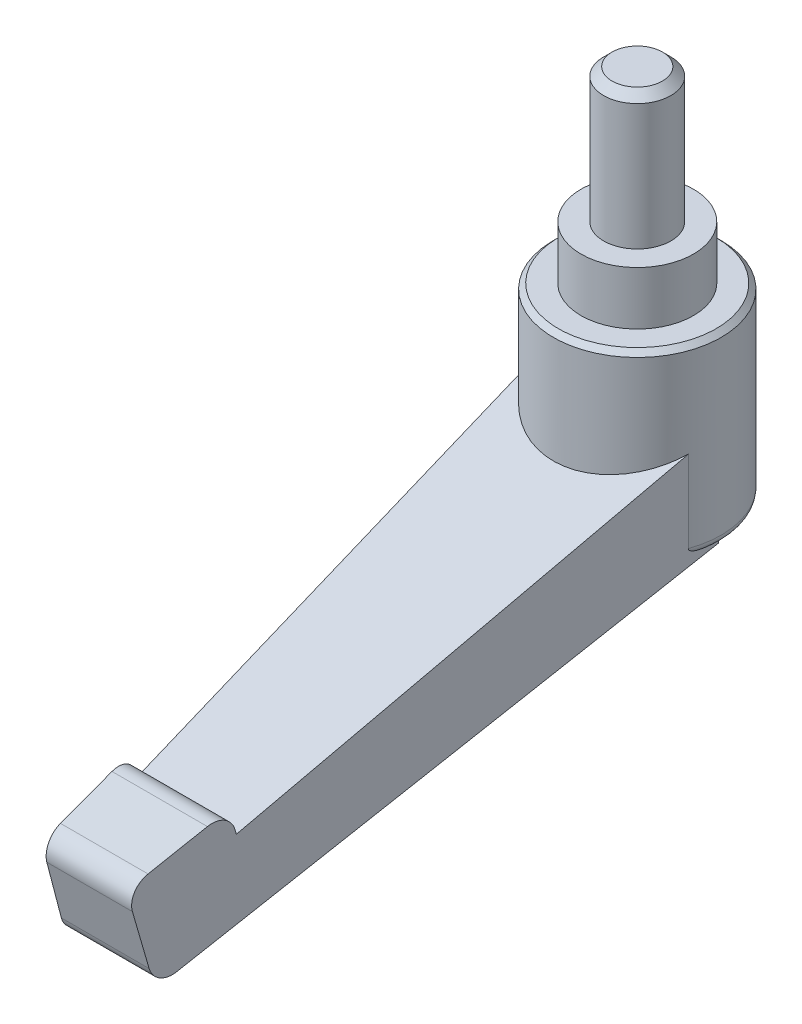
ISO-10303-21;
HEADER;
FILE_DESCRIPTION(('STEP AP214'),'2;1');
FILE_NAME('part.step','',(''),(''),'','','');
FILE_SCHEMA(('AUTOMOTIVE_DESIGN { 1 0 10303 214 1 1 1 1 }'));
ENDSEC;
DATA;
#1=APPLICATION_CONTEXT('core data for automotive mechanical design processes');
#2=APPLICATION_PROTOCOL_DEFINITION('international standard','automotive_design',2000,#1);
#3=PRODUCT_CONTEXT('',#1,'mechanical');
#4=PRODUCT('Part','Part','',(#3));
#5=PRODUCT_RELATED_PRODUCT_CATEGORY('part','',(#4));
#6=PRODUCT_DEFINITION_FORMATION('','',#4);
#7=PRODUCT_DEFINITION_CONTEXT('part definition',#1,'design');
#8=PRODUCT_DEFINITION('design','',#6,#7);
#9=PRODUCT_DEFINITION_SHAPE('','',#8);
#10=(LENGTH_UNIT() NAMED_UNIT(*) SI_UNIT(.MILLI.,.METRE.));
#11=(NAMED_UNIT(*) PLANE_ANGLE_UNIT() SI_UNIT($,.RADIAN.));
#12=(NAMED_UNIT(*) SI_UNIT($,.STERADIAN.) SOLID_ANGLE_UNIT());
#13=UNCERTAINTY_MEASURE_WITH_UNIT(LENGTH_MEASURE(1.E-05),#10,'distance_accuracy_value','');
#14=(GEOMETRIC_REPRESENTATION_CONTEXT(3) GLOBAL_UNCERTAINTY_ASSIGNED_CONTEXT((#13)) GLOBAL_UNIT_ASSIGNED_CONTEXT((#10,
#11,#12)) REPRESENTATION_CONTEXT('',''));
#15=CARTESIAN_POINT('',(0.,0.,0.));
#16=DIRECTION('',(0.,0.,1.));
#17=DIRECTION('',(1.,0.,0.));
#18=AXIS2_PLACEMENT_3D('',#15,#16,#17);
#19=CARTESIAN_POINT('',(18.5,-22.65,30.));
#20=DIRECTION('',(0.,1.,0.));
#21=DIRECTION('',(0.,0.,1.));
#22=AXIS2_PLACEMENT_3D('',#19,#20,#21);
#23=PLANE('',#22);
#24=CARTESIAN_POINT('',(22.5,-22.649999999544,30.));
#25=DIRECTION('',(0.,-1.,0.));
#26=DIRECTION('',(0.,0.,-1.));
#27=AXIS2_PLACEMENT_3D('',#24,#25,#26);
#28=CIRCLE('',#27,3.00000000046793);
#29=CARTESIAN_POINT('',(22.5,-22.649999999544,26.9999999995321));
#30=VERTEX_POINT('',#29);
#31=EDGE_CURVE('E18',#30,#30,#28,.T.);
#32=ORIENTED_EDGE('',*,*,#31,.F.);
#33=EDGE_LOOP('',(#32));
#34=FACE_BOUND('',#33,.T.);
#35=ADVANCED_FACE('F15',(#34),#23,.T.);
#36=CARTESIAN_POINT('',(22.5,-23.6500000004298,30.));
#37=DIRECTION('',(0.,-1.,0.));
#38=DIRECTION('',(0.,0.,-1.));
#39=AXIS2_PLACEMENT_3D('',#36,#37,#38);
#40=CONICAL_SURFACE('',#39,3.99999999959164,0.785398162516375);
#41=CARTESIAN_POINT('',(22.5,-23.65,30.));
#42=DIRECTION('',(0.,-1.,0.));
#43=DIRECTION('',(0.,0.,-1.));
#44=AXIS2_PLACEMENT_3D('',#41,#42,#43);
#45=CIRCLE('',#44,4.0000000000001);
#46=CARTESIAN_POINT('',(22.5,-23.65,25.9999999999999));
#47=VERTEX_POINT('',#46);
#48=EDGE_CURVE('E221',#47,#47,#45,.T.);
#49=ORIENTED_EDGE('',*,*,#48,.F.);
#50=EDGE_LOOP('',(#49));
#51=FACE_BOUND('',#50,.T.);
#52=ORIENTED_EDGE('',*,*,#31,.T.);
#53=EDGE_LOOP('',(#52));
#54=FACE_BOUND('',#53,.T.);
#55=ADVANCED_FACE('F483',(#51,#54),#40,.T.);
#56=CARTESIAN_POINT('',(22.5,-37.,30.));
#57=DIRECTION('',(0.,-1.,0.));
#58=DIRECTION('',(0.,0.,-1.));
#59=AXIS2_PLACEMENT_3D('',#56,#57,#58);
#60=CYLINDRICAL_SURFACE('',#59,4.0000000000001);
#61=ORIENTED_EDGE('',*,*,#48,.T.);
#62=EDGE_LOOP('',(#61));
#63=FACE_BOUND('',#62,.T.);
#64=CARTESIAN_POINT('',(22.5,-38.65,30.));
#65=DIRECTION('',(0.,-1.,0.));
#66=DIRECTION('',(0.,0.,-1.));
#67=AXIS2_PLACEMENT_3D('',#64,#65,#66);
#68=CIRCLE('',#67,4.0000000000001);
#69=CARTESIAN_POINT('',(22.5,-38.65,25.9999999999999));
#70=VERTEX_POINT('',#69);
#71=EDGE_CURVE('E219',#70,#70,#68,.T.);
#72=ORIENTED_EDGE('',*,*,#71,.F.);
#73=EDGE_LOOP('',(#72));
#74=FACE_BOUND('',#73,.T.);
#75=ADVANCED_FACE('F476',(#63,#74),#60,.T.);
#76=CARTESIAN_POINT('',(15.8,-38.65,30.));
#77=DIRECTION('',(0.,1.,0.));
#78=DIRECTION('',(0.,0.,1.));
#79=AXIS2_PLACEMENT_3D('',#76,#77,#78);
#80=PLANE('',#79);
#81=ORIENTED_EDGE('',*,*,#71,.T.);
#82=EDGE_LOOP('',(#81));
#83=FACE_BOUND('',#82,.T.);
#84=CARTESIAN_POINT('',(22.5,-38.65,30.));
#85=DIRECTION('',(0.,1.,0.));
#86=DIRECTION('',(0.,0.,1.));
#87=AXIS2_PLACEMENT_3D('',#84,#85,#86);
#88=CIRCLE('',#87,6.7);
#89=CARTESIAN_POINT('',(22.5,-38.65,36.7));
#90=VERTEX_POINT('',#89);
#91=EDGE_CURVE('E217',#90,#90,#88,.F.);
#92=ORIENTED_EDGE('',*,*,#91,.F.);
#93=EDGE_LOOP('',(#92));
#94=FACE_BOUND('',#93,.T.);
#95=ADVANCED_FACE('F468',(#83,#94),#80,.T.);
#96=CARTESIAN_POINT('',(22.5,-70.,30.));
#97=DIRECTION('',(0.,-1.,0.));
#98=DIRECTION('',(0.,0.,-1.));
#99=AXIS2_PLACEMENT_3D('',#96,#97,#98);
#100=PLANE('',#99);
#101=CARTESIAN_POINT('',(22.5,-70.,30.));
#102=DIRECTION('',(0.,-1.,0.));
#103=DIRECTION('',(0.,0.,-1.));
#104=AXIS2_PLACEMENT_3D('',#101,#102,#103);
#105=CIRCLE('',#104,6.06923098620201);
#106=CARTESIAN_POINT('',(22.5,-70.,23.930769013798));
#107=VERTEX_POINT('',#106);
#108=EDGE_CURVE('E214',#107,#107,#105,.F.);
#109=ORIENTED_EDGE('',*,*,#108,.F.);
#110=EDGE_LOOP('',(#109));
#111=FACE_BOUND('',#110,.T.);
#112=ADVANCED_FACE('F460',(#111),#100,.T.);
#113=CARTESIAN_POINT('',(22.5,-45.,30.));
#114=DIRECTION('',(0.,1.,0.));
#115=DIRECTION('',(0.,0.,1.));
#116=AXIS2_PLACEMENT_3D('',#113,#114,#115);
#117=CYLINDRICAL_SURFACE('',#116,6.7);
#118=CARTESIAN_POINT('',(22.5,-45.,30.));
#119=DIRECTION('',(0.,1.,0.));
#120=DIRECTION('',(0.,0.,1.));
#121=AXIS2_PLACEMENT_3D('',#118,#119,#120);
#122=CIRCLE('',#121,6.7);
#123=CARTESIAN_POINT('',(22.5,-45.,36.7));
#124=VERTEX_POINT('',#123);
#125=EDGE_CURVE('E210',#124,#124,#122,.F.);
#126=ORIENTED_EDGE('',*,*,#125,.F.);
#127=EDGE_LOOP('',(#126));
#128=FACE_BOUND('',#127,.T.);
#129=ORIENTED_EDGE('',*,*,#91,.T.);
#130=EDGE_LOOP('',(#129));
#131=FACE_BOUND('',#130,.T.);
#132=ADVANCED_FACE('F452',(#128,#131),#117,.T.);
#133=CARTESIAN_POINT('',(22.5,-68.5,30.));
#134=DIRECTION('',(0.,-1.,0.));
#135=DIRECTION('',(0.,0.,-1.));
#136=AXIS2_PLACEMENT_3D('',#133,#134,#135);
#137=CYLINDRICAL_SURFACE('',#136,6.06923098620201);
#138=ORIENTED_EDGE('',*,*,#108,.T.);
#139=EDGE_LOOP('',(#138));
#140=FACE_BOUND('',#139,.T.);
#141=CARTESIAN_POINT('',(22.5,-66.9999999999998,30.));
#142=DIRECTION('',(0.,-0.965925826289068,-0.258819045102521));
#143=DIRECTION('',(0.,-0.258819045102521,0.965925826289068));
#144=AXIS2_PLACEMENT_3D('',#141,#142,#143);
#145=ELLIPSE('',#144,6.28333027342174,6.06923098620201);
#146=CARTESIAN_POINT('',(16.430769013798,-67.,30.0000000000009));
#147=VERTEX_POINT('',#146);
#148=CARTESIAN_POINT('',(28.569230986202,-67.,30.0000000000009));
#149=VERTEX_POINT('',#148);
#150=EDGE_CURVE('E93',#147,#149,#145,.F.);
#151=ORIENTED_EDGE('',*,*,#150,.F.);
#152=CARTESIAN_POINT('',(22.5,-67.,30.));
#153=DIRECTION('',(0.,-1.,0.));
#154=DIRECTION('',(0.,0.,-1.));
#155=AXIS2_PLACEMENT_3D('',#152,#153,#154);
#156=CIRCLE('',#155,6.06923098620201);
#157=EDGE_CURVE('E109',#149,#147,#156,.F.);
#158=ORIENTED_EDGE('',*,*,#157,.F.);
#159=EDGE_LOOP('',(#151,#158));
#160=FACE_BOUND('',#159,.T.);
#161=ADVANCED_FACE('F110',(#140,#160),#137,.T.);
#162=CARTESIAN_POINT('',(22.5,-45.,23.2999999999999));
#163=DIRECTION('',(0.,1.,0.));
#164=DIRECTION('',(0.,0.,1.));
#165=AXIS2_PLACEMENT_3D('',#162,#163,#164);
#166=PLANE('',#165);
#167=ORIENTED_EDGE('',*,*,#125,.T.);
#168=EDGE_LOOP('',(#167));
#169=FACE_BOUND('',#168,.T.);
#170=CARTESIAN_POINT('',(22.5,-44.9999999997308,30.));
#171=DIRECTION('',(0.,-1.,0.));
#172=DIRECTION('',(0.,0.,-1.));
#173=AXIS2_PLACEMENT_3D('',#170,#171,#172);
#174=CIRCLE('',#173,9.40000000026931);
#175=CARTESIAN_POINT('',(22.5,-44.9999999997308,20.5999999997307));
#176=VERTEX_POINT('',#175);
#177=EDGE_CURVE('E112',#176,#176,#174,.T.);
#178=ORIENTED_EDGE('',*,*,#177,.F.);
#179=EDGE_LOOP('',(#178));
#180=FACE_BOUND('',#179,.T.);
#181=ADVANCED_FACE('F438',(#169,#180),#166,.T.);
#182=CARTESIAN_POINT('',(32.23,-72.0642139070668,83.6683718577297));
#183=DIRECTION('',(0.,0.264237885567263,-0.964457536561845));
#184=DIRECTION('',(0.,0.964457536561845,0.264237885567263));
#185=AXIS2_PLACEMENT_3D('',#182,#183,#184);
#186=PLANE('',#185);
#187=DIRECTION('',(0.0184741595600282,-0.964292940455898,-0.264192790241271));
#188=VECTOR('',#187,1.);
#189=CARTESIAN_POINT('',(28.3975822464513,-71.5214338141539,83.8170803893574));
#190=LINE('',#189,#188);
#191=CARTESIAN_POINT('',(28.3975822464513,-71.5214338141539,83.8170803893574));
#192=VERTEX_POINT('',#191);
#193=CARTESIAN_POINT('',(28.4079809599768,-72.0642139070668,83.6683718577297));
#194=VERTEX_POINT('',#193);
#195=EDGE_CURVE('E213',#192,#194,#190,.T.);
#196=ORIENTED_EDGE('',*,*,#195,.T.);
#197=DIRECTION('',(1.,0.,0.));
#198=VECTOR('',#197,1.);
#199=CARTESIAN_POINT('',(32.23,-72.0642139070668,83.6683718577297));
#200=LINE('',#199,#198);
#201=CARTESIAN_POINT('',(16.592019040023,-72.0642139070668,83.6683718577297));
#202=VERTEX_POINT('',#201);
#203=EDGE_CURVE('E181',#202,#194,#200,.T.);
#204=ORIENTED_EDGE('',*,*,#203,.F.);
#205=DIRECTION('',(0.0184741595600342,0.964292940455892,0.264192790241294));
#206=VECTOR('',#205,1.);
#207=CARTESIAN_POINT('',(16.592019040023,-72.0642139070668,83.6683718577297));
#208=LINE('',#207,#206);
#209=CARTESIAN_POINT('',(16.6024177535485,-71.5214338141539,83.8170803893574));
#210=VERTEX_POINT('',#209);
#211=EDGE_CURVE('E197',#202,#210,#208,.T.);
#212=ORIENTED_EDGE('',*,*,#211,.T.);
#213=DIRECTION('',(-1.,0.,0.));
#214=VECTOR('',#213,1.);
#215=CARTESIAN_POINT('',(32.23,-71.5214338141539,83.8170803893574));
#216=LINE('',#215,#214);
#217=EDGE_CURVE('E312',#192,#210,#216,.T.);
#218=ORIENTED_EDGE('',*,*,#217,.F.);
#219=EDGE_LOOP('',(#196,#204,#212,#218));
#220=FACE_BOUND('',#219,.T.);
#221=ADVANCED_FACE('F431',(#220),#186,.T.);
#222=CARTESIAN_POINT('',(32.23,-72.1820285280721,86.228224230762));
#223=DIRECTION('',(-1.,0.,0.));
#224=DIRECTION('',(0.,0.,1.));
#225=AXIS2_PLACEMENT_3D('',#222,#223,#224);
#226=CYLINDRICAL_SURFACE('',#225,2.5);
#227=CARTESIAN_POINT('',(28.2289786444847,-72.1820285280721,86.228224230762));
#228=DIRECTION('',(0.997564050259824,0.,0.069756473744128));
#229=DIRECTION('',(-0.069756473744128,0.,0.997564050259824));
#230=AXIS2_PLACEMENT_3D('',#227,#228,#229);
#231=ELLIPSE('',#230,2.50610474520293,2.5);
#232=CARTESIAN_POINT('',(28.1824688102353,-69.772129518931,86.8933458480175));
#233=VERTEX_POINT('',#232);
#234=EDGE_CURVE('E177',#192,#233,#231,.T.);
#235=ORIENTED_EDGE('',*,*,#234,.F.);
#236=ORIENTED_EDGE('',*,*,#217,.T.);
#237=CARTESIAN_POINT('',(16.7710213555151,-72.1820285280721,86.228224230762));
#238=DIRECTION('',(0.997564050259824,0.,-0.069756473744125));
#239=DIRECTION('',(-0.069756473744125,0.,-0.997564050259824));
#240=AXIS2_PLACEMENT_3D('',#237,#238,#239);
#241=ELLIPSE('',#240,2.50610474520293,2.5);
#242=CARTESIAN_POINT('',(16.8175311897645,-69.772129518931,86.8933458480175));
#243=VERTEX_POINT('',#242);
#244=EDGE_CURVE('E196',#210,#243,#241,.T.);
#245=ORIENTED_EDGE('',*,*,#244,.T.);
#246=DIRECTION('',(1.,0.,0.));
#247=VECTOR('',#246,1.);
#248=CARTESIAN_POINT('',(32.23,-69.772129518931,86.8933458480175));
#249=LINE('',#248,#247);
#250=EDGE_CURVE('E309',#233,#243,#249,.F.);
#251=ORIENTED_EDGE('',*,*,#250,.F.);
#252=EDGE_LOOP('',(#235,#236,#245,#251));
#253=FACE_BOUND('',#252,.T.);
#254=ADVANCED_FACE('F334',(#253),#226,.T.);
#255=CARTESIAN_POINT('',(32.23,-69.772129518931,86.8933458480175));
#256=DIRECTION('',(0.,0.96395960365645,0.266048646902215));
#257=DIRECTION('',(0.,-0.266048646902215,0.96395960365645));
#258=AXIS2_PLACEMENT_3D('',#255,#256,#257);
#259=PLANE('',#258);
#260=DIRECTION('',(-0.0672540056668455,-0.265446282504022,0.961777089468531));
#261=VECTOR('',#260,1.);
#262=CARTESIAN_POINT('',(28.1824688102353,-69.772129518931,86.8933458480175));
#263=LINE('',#262,#261);
#264=CARTESIAN_POINT('',(27.7207106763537,-71.5946526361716,93.49679481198));
#265=VERTEX_POINT('',#264);
#266=EDGE_CURVE('E174',#233,#265,#263,.T.);
#267=ORIENTED_EDGE('',*,*,#266,.F.);
#268=ORIENTED_EDGE('',*,*,#250,.T.);
#269=DIRECTION('',(0.0672540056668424,-0.265446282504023,0.961777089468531));
#270=VECTOR('',#269,1.);
#271=CARTESIAN_POINT('',(16.8175311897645,-69.772129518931,86.8933458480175));
#272=LINE('',#271,#270);
#273=CARTESIAN_POINT('',(17.2792893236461,-71.5946526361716,93.49679481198));
#274=VERTEX_POINT('',#273);
#275=EDGE_CURVE('E194',#243,#274,#272,.T.);
#276=ORIENTED_EDGE('',*,*,#275,.T.);
#277=DIRECTION('',(-1.,0.,0.));
#278=VECTOR('',#277,1.);
#279=CARTESIAN_POINT('',(32.23,-71.5946526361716,93.4967948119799));
#280=LINE('',#279,#278);
#281=EDGE_CURVE('E283',#265,#274,#280,.T.);
#282=ORIENTED_EDGE('',*,*,#281,.F.);
#283=EDGE_LOOP('',(#267,#268,#276,#282));
#284=FACE_BOUND('',#283,.T.);
#285=ADVANCED_FACE('F337',(#284),#259,.T.);
#286=CARTESIAN_POINT('',(32.23,-74.0045516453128,92.8316731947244));
#287=DIRECTION('',(-1.,0.,0.));
#288=DIRECTION('',(0.,0.,1.));
#289=AXIS2_PLACEMENT_3D('',#286,#287,#288);
#290=CYLINDRICAL_SURFACE('',#289,2.50000000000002);
#291=CARTESIAN_POINT('',(27.7672205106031,-74.0045516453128,92.8316731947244));
#292=DIRECTION('',(0.997564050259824,0.,0.069756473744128));
#293=DIRECTION('',(-0.069756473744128,0.,0.997564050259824));
#294=AXIS2_PLACEMENT_3D('',#291,#292,#293);
#295=ELLIPSE('',#294,2.50610474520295,2.50000000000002);
#296=CARTESIAN_POINT('',(27.598703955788,-74.6696732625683,95.2415722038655));
#297=VERTEX_POINT('',#296);
#298=EDGE_CURVE('E173',#265,#297,#295,.T.);
#299=ORIENTED_EDGE('',*,*,#298,.F.);
#300=ORIENTED_EDGE('',*,*,#281,.T.);
#301=CARTESIAN_POINT('',(17.2327794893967,-74.0045516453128,92.8316731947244));
#302=DIRECTION('',(0.997564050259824,0.,-0.069756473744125));
#303=DIRECTION('',(-0.069756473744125,0.,-0.997564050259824));
#304=AXIS2_PLACEMENT_3D('',#301,#302,#303);
#305=ELLIPSE('',#304,2.50610474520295,2.50000000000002);
#306=CARTESIAN_POINT('',(17.4012960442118,-74.6696732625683,95.2415722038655));
#307=VERTEX_POINT('',#306);
#308=EDGE_CURVE('E193',#274,#307,#305,.T.);
#309=ORIENTED_EDGE('',*,*,#308,.T.);
#310=DIRECTION('',(1.,0.,0.));
#311=VECTOR('',#310,1.);
#312=CARTESIAN_POINT('',(32.23,-74.6696732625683,95.2415722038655));
#313=LINE('',#312,#311);
#314=EDGE_CURVE('E281',#297,#307,#313,.F.);
#315=ORIENTED_EDGE('',*,*,#314,.F.);
#316=EDGE_LOOP('',(#299,#300,#309,#315));
#317=FACE_BOUND('',#316,.T.);
#318=ADVANCED_FACE('F280',(#317),#290,.T.);
#319=CARTESIAN_POINT('',(32.23,-74.6696732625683,95.2415722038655));
#320=DIRECTION('',(0.,-0.266048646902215,0.96395960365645));
#321=DIRECTION('',(0.,-0.96395960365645,-0.266048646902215));
#322=AXIS2_PLACEMENT_3D('',#319,#320,#321);
#323=PLANE('',#322);
#324=DIRECTION('',(0.0186007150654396,-0.963792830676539,-0.266002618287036));
#325=VECTOR('',#324,1.);
#326=CARTESIAN_POINT('',(27.598703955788,-74.6696732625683,95.2415722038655));
#327=LINE('',#326,#325);
#328=CARTESIAN_POINT('',(27.7288636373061,-81.4138746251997,93.3802020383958));
#329=VERTEX_POINT('',#328);
#330=EDGE_CURVE('E170',#297,#329,#327,.T.);
#331=ORIENTED_EDGE('',*,*,#330,.F.);
#332=ORIENTED_EDGE('',*,*,#314,.T.);
#333=DIRECTION('',(-0.0186007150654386,-0.963792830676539,-0.266002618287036));
#334=VECTOR('',#333,1.);
#335=CARTESIAN_POINT('',(17.4012960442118,-74.6696732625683,95.2415722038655));
#336=LINE('',#335,#334);
#337=CARTESIAN_POINT('',(17.2711363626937,-81.4138746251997,93.3802020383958));
#338=VERTEX_POINT('',#337);
#339=EDGE_CURVE('E191',#307,#338,#336,.T.);
#340=ORIENTED_EDGE('',*,*,#339,.T.);
#341=DIRECTION('',(-1.,0.,0.));
#342=VECTOR('',#341,1.);
#343=CARTESIAN_POINT('',(32.23,-81.4138746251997,93.3802020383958));
#344=LINE('',#343,#342);
#345=EDGE_CURVE('E107',#329,#338,#344,.T.);
#346=ORIENTED_EDGE('',*,*,#345,.F.);
#347=EDGE_LOOP('',(#331,#332,#340,#346));
#348=FACE_BOUND('',#347,.T.);
#349=ADVANCED_FACE('F288',(#348),#323,.T.);
#350=CARTESIAN_POINT('',(32.23,-80.7487530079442,90.9703030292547));
#351=DIRECTION('',(-1.,0.,0.));
#352=DIRECTION('',(0.,0.,1.));
#353=AXIS2_PLACEMENT_3D('',#350,#351,#352);
#354=CYLINDRICAL_SURFACE('',#353,2.50000000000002);
#355=CARTESIAN_POINT('',(27.8973801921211,-80.7487530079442,90.9703030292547));
#356=DIRECTION('',(0.997564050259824,0.,0.069756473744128));
#357=DIRECTION('',(-0.069756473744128,0.,0.997564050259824));
#358=AXIS2_PLACEMENT_3D('',#355,#356,#357);
#359=ELLIPSE('',#358,2.50610474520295,2.50000000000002);
#360=CARTESIAN_POINT('',(27.9426261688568,-83.1635675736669,90.3232554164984));
#361=VERTEX_POINT('',#360);
#362=EDGE_CURVE('E169',#329,#361,#359,.T.);
#363=ORIENTED_EDGE('',*,*,#362,.F.);
#364=ORIENTED_EDGE('',*,*,#345,.T.);
#365=CARTESIAN_POINT('',(17.1026198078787,-80.7487530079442,90.9703030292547));
#366=DIRECTION('',(0.997564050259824,0.,-0.069756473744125));
#367=DIRECTION('',(-0.069756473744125,0.,-0.997564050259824));
#368=AXIS2_PLACEMENT_3D('',#365,#366,#367);
#369=ELLIPSE('',#368,2.50610474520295,2.50000000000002);
#370=CARTESIAN_POINT('',(17.0573738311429,-83.1635675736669,90.3232554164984));
#371=VERTEX_POINT('',#370);
#372=EDGE_CURVE('E190',#338,#371,#369,.T.);
#373=ORIENTED_EDGE('',*,*,#372,.T.);
#374=DIRECTION('',(1.,0.,0.));
#375=VECTOR('',#374,1.);
#376=CARTESIAN_POINT('',(32.23,-83.1635675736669,90.3232554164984));
#377=LINE('',#376,#375);
#378=EDGE_CURVE('E106',#361,#371,#377,.F.);
#379=ORIENTED_EDGE('',*,*,#378,.F.);
#380=EDGE_LOOP('',(#363,#364,#373,#379));
#381=FACE_BOUND('',#380,.T.);
#382=ADVANCED_FACE('F298',(#381),#354,.T.);
#383=CARTESIAN_POINT('',(32.23,-83.1635675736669,90.3232554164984));
#384=DIRECTION('',(0.,-0.965925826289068,-0.258819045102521));
#385=DIRECTION('',(0.,0.258819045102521,-0.965925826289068));
#386=AXIS2_PLACEMENT_3D('',#383,#384,#385);
#387=PLANE('',#386);
#388=DIRECTION('',(-1.,0.,0.));
#389=VECTOR('',#388,1.);
#390=CARTESIAN_POINT('',(32.23,-67.,30.));
#391=LINE('',#390,#389);
#392=CARTESIAN_POINT('',(13.5,-67.,30.0000000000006));
#393=VERTEX_POINT('',#392);
#394=CARTESIAN_POINT('',(12.8391608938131,-66.9999999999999,30.));
#395=VERTEX_POINT('',#394);
#396=EDGE_CURVE('E301',#393,#395,#391,.T.);
#397=ORIENTED_EDGE('',*,*,#396,.F.);
#398=DIRECTION('',(1.,0.,0.));
#399=VECTOR('',#398,1.);
#400=CARTESIAN_POINT('',(22.5,-67.,30.0000000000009));
#401=LINE('',#400,#399);
#402=EDGE_CURVE('E104',#147,#393,#401,.F.);
#403=ORIENTED_EDGE('',*,*,#402,.F.);
#404=ORIENTED_EDGE('',*,*,#150,.T.);
#405=DIRECTION('',(1.,0.,0.));
#406=VECTOR('',#405,1.);
#407=CARTESIAN_POINT('',(22.5,-67.,30.0000000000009));
#408=LINE('',#407,#406);
#409=CARTESIAN_POINT('',(31.5,-67.,30.0000000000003));
#410=VERTEX_POINT('',#409);
#411=EDGE_CURVE('E101',#410,#149,#408,.F.);
#412=ORIENTED_EDGE('',*,*,#411,.F.);
#413=DIRECTION('',(-1.,0.,0.));
#414=VECTOR('',#413,1.);
#415=CARTESIAN_POINT('',(32.23,-66.9999999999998,30.));
#416=LINE('',#415,#414);
#417=CARTESIAN_POINT('',(32.1608391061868,-66.9999999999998,30.));
#418=VERTEX_POINT('',#417);
#419=EDGE_CURVE('E121',#418,#410,#416,.T.);
#420=ORIENTED_EDGE('',*,*,#419,.F.);
#421=DIRECTION('',(0.0673905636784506,0.258230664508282,-0.963729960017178));
#422=VECTOR('',#421,1.);
#423=CARTESIAN_POINT('',(27.9426261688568,-83.1635675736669,90.3232554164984));
#424=LINE('',#423,#422);
#425=EDGE_CURVE('E166',#361,#418,#424,.T.);
#426=ORIENTED_EDGE('',*,*,#425,.F.);
#427=ORIENTED_EDGE('',*,*,#378,.T.);
#428=DIRECTION('',(-0.0673905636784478,0.258230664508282,-0.963729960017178));
#429=VECTOR('',#428,1.);
#430=CARTESIAN_POINT('',(17.0573738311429,-83.1635675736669,90.3232554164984));
#431=LINE('',#430,#429);
#432=EDGE_CURVE('E187',#371,#395,#431,.T.);
#433=ORIENTED_EDGE('',*,*,#432,.T.);
#434=EDGE_LOOP('',(#397,#403,#404,#412,#420,#426,#427,#433));
#435=FACE_BOUND('',#434,.T.);
#436=ADVANCED_FACE('F98',(#435),#387,.T.);
#437=CARTESIAN_POINT('',(32.23,-66.9999999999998,30.));
#438=DIRECTION('',(0.,0.,-1.));
#439=DIRECTION('',(-1.,0.,0.));
#440=AXIS2_PLACEMENT_3D('',#437,#438,#439);
#441=PLANE('',#440);
#442=ORIENTED_EDGE('',*,*,#396,.T.);
#443=DIRECTION('',(0.,1.,0.));
#444=VECTOR('',#443,1.);
#445=CARTESIAN_POINT('',(12.8391608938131,-60.0000000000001,30.));
#446=LINE('',#445,#444);
#447=CARTESIAN_POINT('',(12.8391608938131,-66.7505275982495,30.0000000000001));
#448=VERTEX_POINT('',#447);
#449=EDGE_CURVE('E185',#395,#448,#446,.T.);
#450=ORIENTED_EDGE('',*,*,#449,.T.);
#451=CARTESIAN_POINT('',(13.5,-67.,30.));
#452=CARTESIAN_POINT('',(13.4718991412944,-66.9999995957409,30.));
#453=CARTESIAN_POINT('',(13.4438120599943,-66.9988146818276,30.));
#454=CARTESIAN_POINT('',(13.3878374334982,-66.9940872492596,30.));
#455=CARTESIAN_POINT('',(13.3599498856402,-66.9905447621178,30.));
#456=CARTESIAN_POINT('',(13.2768035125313,-66.9763912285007,30.));
#457=CARTESIAN_POINT('',(13.2221018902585,-66.9622541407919,30.));
#458=CARTESIAN_POINT('',(13.1158532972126,-66.9249916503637,30.));
#459=CARTESIAN_POINT('',(13.064308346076,-66.9018605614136,30.));
#460=CARTESIAN_POINT('',(12.9659501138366,-66.8473110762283,30.));
#461=CARTESIAN_POINT('',(12.9191237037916,-66.8159166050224,30.));
#462=CARTESIAN_POINT('',(12.8630162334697,-66.7710398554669,30.));
#463=CARTESIAN_POINT('',(12.8509621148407,-66.7609217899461,30.));
#464=CARTESIAN_POINT('',(12.8391608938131,-66.7505275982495,30.));
#465=B_SPLINE_CURVE_WITH_KNOTS('',3,(#451,#452,#453,#454,#455,#456,#457,#458,#459,#460,#461,
#462,#463,#464),.UNSPECIFIED.,.F.,.F.,(4,2,2,2,2,2,4),(0.,0.0842502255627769,0.168499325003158,
0.337118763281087,0.505844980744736,0.674087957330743,0.721281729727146),.UNSPECIFIED.);
#466=EDGE_CURVE('E165',#393,#448,#465,.T.);
#467=ORIENTED_EDGE('',*,*,#466,.F.);
#468=EDGE_LOOP('',(#442,#450,#467));
#469=FACE_BOUND('',#468,.T.);
#470=ADVANCED_FACE('F253',(#469),#441,.T.);
#471=CARTESIAN_POINT('',(32.23,-66.9999999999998,30.));
#472=DIRECTION('',(0.,0.,-1.));
#473=DIRECTION('',(-1.,0.,0.));
#474=AXIS2_PLACEMENT_3D('',#471,#472,#473);
#475=PLANE('',#474);
#476=DIRECTION('',(0.,1.,0.));
#477=VECTOR('',#476,1.);
#478=CARTESIAN_POINT('',(32.1608391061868,-60.0000000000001,30.));
#479=LINE('',#478,#477);
#480=CARTESIAN_POINT('',(32.1608391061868,-66.7505275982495,30.));
#481=VERTEX_POINT('',#480);
#482=EDGE_CURVE('E163',#418,#481,#479,.T.);
#483=ORIENTED_EDGE('',*,*,#482,.F.);
#484=ORIENTED_EDGE('',*,*,#419,.T.);
#485=CARTESIAN_POINT('',(32.1608391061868,-66.7505275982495,30.));
#486=CARTESIAN_POINT('',(32.1397483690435,-66.769097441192,30.));
#487=CARTESIAN_POINT('',(32.1178852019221,-66.7867691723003,30.));
#488=CARTESIAN_POINT('',(32.0727506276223,-66.820211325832,30.));
#489=CARTESIAN_POINT('',(32.049479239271,-66.8359817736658,30.));
#490=CARTESIAN_POINT('',(31.9777223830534,-66.8803055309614,30.));
#491=CARTESIAN_POINT('',(31.9273249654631,-66.9058442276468,30.));
#492=CARTESIAN_POINT('',(31.8229579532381,-66.948090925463,30.));
#493=CARTESIAN_POINT('',(31.7689861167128,-66.964793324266,30.));
#494=CARTESIAN_POINT('',(31.6591171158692,-66.9888513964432,30.));
#495=CARTESIAN_POINT('',(31.6032259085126,-66.9962337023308,30.));
#496=CARTESIAN_POINT('',(31.5314593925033,-66.9996304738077,30.));
#497=CARTESIAN_POINT('',(31.5157260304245,-67.000002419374,30.));
#498=CARTESIAN_POINT('',(31.5,-67.,30.));
#499=B_SPLINE_CURVE_WITH_KNOTS('',3,(#485,#486,#487,#488,#489,#490,#491,#492,#493,#494,#495,
#496,#497,#498),.UNSPECIFIED.,.F.,.F.,(4,2,2,2,2,2,4),(0.,0.0842502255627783,0.168499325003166,
0.337118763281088,0.505844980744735,0.674087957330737,0.721281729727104),.UNSPECIFIED.);
#500=EDGE_CURVE('E238',#481,#410,#499,.T.);
#501=ORIENTED_EDGE('',*,*,#500,.F.);
#502=EDGE_LOOP('',(#483,#484,#501));
#503=FACE_BOUND('',#502,.T.);
#504=ADVANCED_FACE('F249',(#503),#475,.T.);
#505=CARTESIAN_POINT('',(22.5,-67.,22.465384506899));
#506=DIRECTION('',(0.,-1.,0.));
#507=DIRECTION('',(0.,0.,-1.));
#508=AXIS2_PLACEMENT_3D('',#505,#506,#507);
#509=PLANE('',#508);
#510=ORIENTED_EDGE('',*,*,#411,.T.);
#511=ORIENTED_EDGE('',*,*,#157,.T.);
#512=ORIENTED_EDGE('',*,*,#402,.T.);
#513=CARTESIAN_POINT('',(22.5,-67.,30.));
#514=DIRECTION('',(0.,1.,0.));
#515=DIRECTION('',(1.,0.,0.));
#516=AXIS2_PLACEMENT_3D('',#513,#514,#515);
#517=CIRCLE('',#516,9.);
#518=EDGE_CURVE('E117',#410,#393,#517,.T.);
#519=ORIENTED_EDGE('',*,*,#518,.F.);
#520=EDGE_LOOP('',(#510,#511,#512,#519));
#521=FACE_BOUND('',#520,.T.);
#522=ADVANCED_FACE('F115',(#521),#509,.T.);
#523=CARTESIAN_POINT('',(22.5,-45.6000000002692,30.));
#524=DIRECTION('',(0.,-1.,0.));
#525=DIRECTION('',(0.,0.,-1.));
#526=AXIS2_PLACEMENT_3D('',#523,#524,#525);
#527=CONICAL_SURFACE('',#526,9.99999999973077,0.785398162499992);
#528=ORIENTED_EDGE('',*,*,#177,.T.);
#529=EDGE_LOOP('',(#528));
#530=FACE_BOUND('',#529,.T.);
#531=CARTESIAN_POINT('',(22.5,-45.5999999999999,30.));
#532=DIRECTION('',(0.,-1.,0.));
#533=DIRECTION('',(0.,0.,-1.));
#534=AXIS2_PLACEMENT_3D('',#531,#532,#533);
#535=CIRCLE('',#534,10.);
#536=CARTESIAN_POINT('',(22.5,-45.5999999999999,20.));
#537=VERTEX_POINT('',#536);
#538=EDGE_CURVE('E508',#537,#537,#535,.T.);
#539=ORIENTED_EDGE('',*,*,#538,.F.);
#540=EDGE_LOOP('',(#539));
#541=FACE_BOUND('',#540,.T.);
#542=ADVANCED_FACE('F349',(#530,#541),#527,.T.);
#543=CARTESIAN_POINT('',(15.6117703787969,-60.0000000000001,69.6501629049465));
#544=DIRECTION('',(0.997564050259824,0.,-0.069756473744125));
#545=DIRECTION('',(-0.069756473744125,0.,-0.997564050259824));
#546=AXIS2_PLACEMENT_3D('',#543,#544,#545);
#547=PLANE('',#546);
#548=ORIENTED_EDGE('',*,*,#449,.F.);
#549=ORIENTED_EDGE('',*,*,#432,.F.);
#550=ORIENTED_EDGE('',*,*,#372,.F.);
#551=ORIENTED_EDGE('',*,*,#339,.F.);
#552=ORIENTED_EDGE('',*,*,#308,.F.);
#553=ORIENTED_EDGE('',*,*,#275,.F.);
#554=ORIENTED_EDGE('',*,*,#244,.F.);
#555=ORIENTED_EDGE('',*,*,#211,.F.);
#556=DIRECTION('',(0.0665654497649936,-0.298994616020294,0.951930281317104));
#557=VECTOR('',#556,1.);
#558=CARTESIAN_POINT('',(13.0723342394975,-56.254708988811,33.3345341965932));
#559=LINE('',#558,#557);
#560=CARTESIAN_POINT('',(13.0723342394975,-56.254708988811,33.3345341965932));
#561=VERTEX_POINT('',#560);
#562=EDGE_CURVE('E182',#561,#202,#559,.T.);
#563=ORIENTED_EDGE('',*,*,#562,.F.);
#564=DIRECTION('',(0.,-1.,0.));
#565=VECTOR('',#564,1.);
#566=CARTESIAN_POINT('',(13.0723342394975,-55.8,33.3345341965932));
#567=LINE('',#566,#565);
#568=CARTESIAN_POINT('',(13.0723342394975,-66.,33.3345341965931));
#569=VERTEX_POINT('',#568);
#570=EDGE_CURVE('E237',#569,#561,#567,.F.);
#571=ORIENTED_EDGE('',*,*,#570,.F.);
#572=CARTESIAN_POINT('',(12.8391608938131,-66.7505275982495,30.0000000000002));
#573=CARTESIAN_POINT('',(12.8430417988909,-66.7539418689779,30.0554995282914));
#574=CARTESIAN_POINT('',(12.8469245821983,-66.7568893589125,30.1110259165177));
#575=CARTESIAN_POINT('',(12.8546928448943,-66.7619022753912,30.2221172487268));
#576=CARTESIAN_POINT('',(12.8585783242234,-66.7639677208,30.2776821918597));
#577=CARTESIAN_POINT('',(12.8702528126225,-66.7689249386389,30.4446351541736));
#578=CARTESIAN_POINT('',(12.8780445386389,-66.7705645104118,30.5560620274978));
#579=CARTESIAN_POINT('',(12.8936347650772,-66.7706555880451,30.7790126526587));
#580=CARTESIAN_POINT('',(12.9014332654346,-66.7691042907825,30.8905364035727));
#581=CARTESIAN_POINT('',(12.9170366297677,-66.7626680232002,31.1136749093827));
#582=CARTESIAN_POINT('',(12.924841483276,-66.7577776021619,31.2252895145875));
#583=CARTESIAN_POINT('',(12.9404308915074,-66.7442282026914,31.4482284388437));
#584=CARTESIAN_POINT('',(12.9482154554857,-66.735571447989,31.5595528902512));
#585=CARTESIAN_POINT('',(12.9637503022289,-66.7137006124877,31.7817115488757));
#586=CARTESIAN_POINT('',(12.971500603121,-66.7004893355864,31.8925460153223));
#587=CARTESIAN_POINT('',(12.981954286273,-66.6785900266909,32.0420406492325));
#588=CARTESIAN_POINT('',(12.9846843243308,-66.6724915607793,32.0810820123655));
#589=CARTESIAN_POINT('',(12.990134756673,-66.6594587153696,32.1590268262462));
#590=CARTESIAN_POINT('',(12.9928551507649,-66.6525243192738,32.1979302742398));
#591=CARTESIAN_POINT('',(13.0010046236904,-66.6303021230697,32.3144731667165));
#592=CARTESIAN_POINT('',(13.0064154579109,-66.6136085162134,32.3918517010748));
#593=CARTESIAN_POINT('',(13.01738651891,-66.57454970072,32.5487451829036));
#594=CARTESIAN_POINT('',(13.0229432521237,-66.5519726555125,32.6282101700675));
#595=CARTESIAN_POINT('',(13.0311433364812,-66.5125817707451,32.745476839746));
#596=CARTESIAN_POINT('',(13.0338515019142,-66.4985477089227,32.784205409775));
#597=CARTESIAN_POINT('',(13.0392049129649,-66.4682160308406,32.8607627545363));
#598=CARTESIAN_POINT('',(13.0418501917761,-66.4519196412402,32.8985920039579));
#599=CARTESIAN_POINT('',(13.0465617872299,-66.4198047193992,32.9659709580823));
#600=CARTESIAN_POINT('',(13.0486439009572,-66.4044662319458,32.9957465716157));
#601=CARTESIAN_POINT('',(13.0527221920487,-66.3714540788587,33.0540688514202));
#602=CARTESIAN_POINT('',(13.0547182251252,-66.3537766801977,33.0826134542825));
#603=CARTESIAN_POINT('',(13.0585901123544,-66.3153634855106,33.1379840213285));
#604=CARTESIAN_POINT('',(13.0604647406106,-66.2946019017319,33.1647924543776));
#605=CARTESIAN_POINT('',(13.0639850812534,-66.2493615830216,33.2151356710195));
#606=CARTESIAN_POINT('',(13.0656313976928,-66.2248930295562,33.2386790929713));
#607=CARTESIAN_POINT('',(13.067871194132,-66.1836168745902,33.2707096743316));
#608=CARTESIAN_POINT('',(13.0686034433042,-66.1683708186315,33.2811813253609));
#609=CARTESIAN_POINT('',(13.0699055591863,-66.13656994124,33.299802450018));
#610=CARTESIAN_POINT('',(13.0704760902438,-66.1200208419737,33.3079614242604));
#611=CARTESIAN_POINT('',(13.0713849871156,-66.0866155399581,33.3209592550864));
#612=CARTESIAN_POINT('',(13.0717339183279,-66.0698204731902,33.3259492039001));
#613=CARTESIAN_POINT('',(13.0720903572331,-66.0440474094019,33.3310465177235));
#614=CARTESIAN_POINT('',(13.0721813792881,-66.0352977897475,33.3323481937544));
#615=CARTESIAN_POINT('',(13.0723034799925,-66.01770091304,33.3340943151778));
#616=CARTESIAN_POINT('',(13.0723344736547,-66.0088535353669,33.3345375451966));
#617=CARTESIAN_POINT('',(13.0723342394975,-66.,33.3345341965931));
#618=B_SPLINE_CURVE_WITH_KNOTS('',3,(#572,#573,#574,#575,#576,#577,#578,#579,#580,#581,#582,
#583,#584,#585,#586,#587,#588,#589,#590,#591,#592,#593,#594,#595,#596,#597,#598,#599,#600,#601,
#602,#603,#604,#605,#606,#607,#608,#609,#610,#611,#612,#613,#614,#615,#616,#617),.UNSPECIFIED.,
.F.,.F.,(4,2,2,2,2,2,2,2,2,2,2,2,2,2,2,2,2,2,2,2,2,2,4),(0.,0.167214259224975,0.334424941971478,
0.669506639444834,1.00488282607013,1.34080778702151,1.67653467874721,2.01205525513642,
2.13087487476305,2.24969685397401,2.48762436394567,2.73571678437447,2.85951074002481,
2.98323783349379,3.08383819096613,3.18460109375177,3.28625962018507,3.38764383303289,
3.44302569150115,3.49817662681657,3.55044837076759,3.57694913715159,3.60348739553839),.UNSPECIFIED.);
#619=EDGE_CURVE('E341',#448,#569,#618,.T.);
#620=ORIENTED_EDGE('',*,*,#619,.F.);
#621=EDGE_LOOP('',(#548,#549,#550,#551,#552,#553,#554,#555,#563,#571,#620));
#622=FACE_BOUND('',#621,.T.);
#623=ADVANCED_FACE('F293',(#622),#547,.F.);
#624=CARTESIAN_POINT('',(32.23,-55.2073552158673,30.0000000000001));
#625=DIRECTION('',(0.,0.954046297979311,0.299659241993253));
#626=DIRECTION('',(0.,-0.299659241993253,0.954046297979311));
#627=AXIS2_PLACEMENT_3D('',#624,#625,#626);
#628=PLANE('',#627);
#629=ORIENTED_EDGE('',*,*,#203,.T.);
#630=DIRECTION('',(-0.0665654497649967,-0.298994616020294,0.951930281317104));
#631=VECTOR('',#630,1.);
#632=CARTESIAN_POINT('',(31.9276657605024,-56.254708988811,33.3345341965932));
#633=LINE('',#632,#631);
#634=CARTESIAN_POINT('',(31.9276657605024,-56.254708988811,33.3345341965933));
#635=VERTEX_POINT('',#634);
#636=EDGE_CURVE('E178',#635,#194,#633,.T.);
#637=ORIENTED_EDGE('',*,*,#636,.F.);
#638=CARTESIAN_POINT('',(22.5,-55.2073552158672,30.));
#639=DIRECTION('',(0.,0.954046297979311,0.299659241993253));
#640=DIRECTION('',(0.,-0.299659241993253,0.954046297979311));
#641=AXIS2_PLACEMENT_3D('',#638,#639,#640);
#642=ELLIPSE('',#641,10.4816716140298,10.);
#643=EDGE_CURVE('E234',#561,#635,#642,.T.);
#644=ORIENTED_EDGE('',*,*,#643,.F.);
#645=ORIENTED_EDGE('',*,*,#562,.T.);
#646=EDGE_LOOP('',(#629,#637,#644,#645));
#647=FACE_BOUND('',#646,.T.);
#648=ADVANCED_FACE('F315',(#647),#628,.T.);
#649=CARTESIAN_POINT('',(29.388229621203,-60.0000000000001,69.6501629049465));
#650=DIRECTION('',(0.997564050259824,0.,0.069756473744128));
#651=DIRECTION('',(0.069756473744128,0.,-0.997564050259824));
#652=AXIS2_PLACEMENT_3D('',#649,#650,#651);
#653=PLANE('',#652);
#654=ORIENTED_EDGE('',*,*,#425,.T.);
#655=ORIENTED_EDGE('',*,*,#482,.T.);
#656=CARTESIAN_POINT('',(31.9276657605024,-66.,33.3345341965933));
#657=CARTESIAN_POINT('',(31.9276655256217,-66.0088862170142,33.334537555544));
#658=CARTESIAN_POINT('',(31.927696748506,-66.0177660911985,33.3340910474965));
#659=CARTESIAN_POINT('',(31.9278197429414,-66.0354271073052,33.3323321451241));
#660=CARTESIAN_POINT('',(31.9279114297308,-66.0442083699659,33.3310209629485));
#661=CARTESIAN_POINT('',(31.9282706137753,-66.0700847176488,33.3258843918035));
#662=CARTESIAN_POINT('',(31.9286223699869,-66.0869488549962,33.3208540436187));
#663=CARTESIAN_POINT('',(31.9295114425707,-66.1194981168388,33.308139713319));
#664=CARTESIAN_POINT('',(31.9300477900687,-66.1351888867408,33.3004695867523));
#665=CARTESIAN_POINT('',(31.9312665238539,-66.1654050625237,33.2830408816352));
#666=CARTESIAN_POINT('',(31.9319494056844,-66.1799262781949,33.2732752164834));
#667=CARTESIAN_POINT('',(31.9340590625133,-66.2197587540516,33.2431057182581));
#668=CARTESIAN_POINT('',(31.9356201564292,-66.2435973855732,33.2207810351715));
#669=CARTESIAN_POINT('',(31.9389645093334,-66.2877869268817,33.1729545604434));
#670=CARTESIAN_POINT('',(31.9407484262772,-66.3081270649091,33.1474433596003));
#671=CARTESIAN_POINT('',(31.9449698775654,-66.3512865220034,33.0870737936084));
#672=CARTESIAN_POINT('',(31.9474510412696,-66.3732176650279,33.0515914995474));
#673=CARTESIAN_POINT('',(31.9525479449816,-66.4136408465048,32.9787023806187));
#674=CARTESIAN_POINT('',(31.955163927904,-66.4321263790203,32.9412920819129));
#675=CARTESIAN_POINT('',(31.9604927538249,-66.4664659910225,32.865086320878));
#676=CARTESIAN_POINT('',(31.9632060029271,-66.4823069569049,32.8262850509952));
#677=CARTESIAN_POINT('',(31.9686868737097,-66.5117744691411,32.747904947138));
#678=CARTESIAN_POINT('',(31.9714544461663,-66.5254029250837,32.7083268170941));
#679=CARTESIAN_POINT('',(31.9773050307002,-66.5521103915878,32.6246595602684));
#680=CARTESIAN_POINT('',(31.9803921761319,-66.5650018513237,32.5805113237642));
#681=CARTESIAN_POINT('',(31.9866006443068,-66.5889784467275,32.4917260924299));
#682=CARTESIAN_POINT('',(31.9897219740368,-66.6000632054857,32.447088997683));
#683=CARTESIAN_POINT('',(31.9991334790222,-66.6310795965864,32.3124982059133));
#684=CARTESIAN_POINT('',(32.0054603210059,-66.6487263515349,32.2220201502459));
#685=CARTESIAN_POINT('',(32.0181713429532,-66.6794960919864,32.0402440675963));
#686=CARTESIAN_POINT('',(32.0245555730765,-66.6926146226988,31.9489453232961));
#687=CARTESIAN_POINT('',(32.0373675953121,-66.7152878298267,31.7657248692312));
#688=CARTESIAN_POINT('',(32.0437954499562,-66.7248351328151,31.6738022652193));
#689=CARTESIAN_POINT('',(32.0566607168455,-66.7409580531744,31.4898203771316));
#690=CARTESIAN_POINT('',(32.0630981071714,-66.7475373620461,31.3977614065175));
#691=CARTESIAN_POINT('',(32.0759812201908,-66.7581520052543,31.2135243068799));
#692=CARTESIAN_POINT('',(32.0824269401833,-66.7621880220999,31.1213462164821));
#693=CARTESIAN_POINT('',(32.0928907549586,-66.7668701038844,30.9717066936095));
#694=CARTESIAN_POINT('',(32.0969074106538,-66.768220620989,30.9142658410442));
#695=CARTESIAN_POINT('',(32.1049423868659,-66.7700578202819,30.7993603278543));
#696=CARTESIAN_POINT('',(32.1089607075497,-66.7705443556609,30.7418956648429));
#697=CARTESIAN_POINT('',(32.1169977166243,-66.7706649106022,30.6269610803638));
#698=CARTESIAN_POINT('',(32.1210164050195,-66.7702988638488,30.5694911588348));
#699=CARTESIAN_POINT('',(32.1290160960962,-66.7687125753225,30.4550902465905));
#700=CARTESIAN_POINT('',(32.1329971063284,-66.767500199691,30.398159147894));
#701=CARTESIAN_POINT('',(32.1409570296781,-66.7642038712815,30.2843269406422));
#702=CARTESIAN_POINT('',(32.1449359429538,-66.7621199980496,30.2274258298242));
#703=CARTESIAN_POINT('',(32.1528902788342,-66.7570290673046,30.1136735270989));
#704=CARTESIAN_POINT('',(32.1568657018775,-66.754022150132,30.0568223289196));
#705=CARTESIAN_POINT('',(32.1608391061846,-66.7505275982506,30.));
#706=B_SPLINE_CURVE_WITH_KNOTS('',3,(#656,#657,#658,#659,#660,#661,#662,#663,#664,#665,#666,
#667,#668,#669,#670,#671,#672,#673,#674,#675,#676,#677,#678,#679,#680,#681,#682,#683,#684,#685,
#686,#687,#688,#689,#690,#691,#692,#693,#694,#695,#696,#697,#698,#699,#700,#701,#702,#703,#704,
#705),.UNSPECIFIED.,.F.,.F.,(4,2,2,2,2,2,2,2,2,2,2,2,2,2,2,2,2,2,2,2,2,2,2,2,4),(0.,
0.02663582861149,0.0532343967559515,0.105734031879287,0.157962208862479,0.210369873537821,
0.307893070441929,0.405711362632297,0.530783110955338,0.656088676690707,0.781998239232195,
0.907798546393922,1.04603693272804,1.18430412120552,1.46132477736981,1.73861719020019,
2.01647900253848,2.2939942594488,2.57143501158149,2.74422017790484,2.91703470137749,
3.08986266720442,3.26110532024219,3.43233234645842,3.60353335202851),.UNSPECIFIED.);
#707=CARTESIAN_POINT('',(31.9276657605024,-66.,33.3345341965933));
#708=VERTEX_POINT('',#707);
#709=EDGE_CURVE('E33',#708,#481,#706,.T.);
#710=ORIENTED_EDGE('',*,*,#709,.F.);
#711=DIRECTION('',(0.,-1.,0.));
#712=VECTOR('',#711,1.);
#713=CARTESIAN_POINT('',(31.9276657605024,-55.8,33.3345341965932));
#714=LINE('',#713,#712);
#715=EDGE_CURVE('E24',#635,#708,#714,.T.);
#716=ORIENTED_EDGE('',*,*,#715,.F.);
#717=ORIENTED_EDGE('',*,*,#636,.T.);
#718=ORIENTED_EDGE('',*,*,#195,.F.);
#719=ORIENTED_EDGE('',*,*,#234,.T.);
#720=ORIENTED_EDGE('',*,*,#266,.T.);
#721=ORIENTED_EDGE('',*,*,#298,.T.);
#722=ORIENTED_EDGE('',*,*,#330,.T.);
#723=ORIENTED_EDGE('',*,*,#362,.T.);
#724=EDGE_LOOP('',(#654,#655,#710,#716,#717,#718,#719,#720,#721,#722,#723));
#725=FACE_BOUND('',#724,.T.);
#726=ADVANCED_FACE('F152',(#725),#653,.T.);
#727=CARTESIAN_POINT('',(22.5,-66.,30.));
#728=DIRECTION('',(0.,-1.,0.));
#729=DIRECTION('',(0.,0.,1.));
#730=AXIS2_PLACEMENT_3D('',#727,#728,#729);
#731=TOROIDAL_SURFACE('',#730,9.,1.);
#732=ORIENTED_EDGE('',*,*,#500,.T.);
#733=ORIENTED_EDGE('',*,*,#518,.T.);
#734=ORIENTED_EDGE('',*,*,#466,.T.);
#735=ORIENTED_EDGE('',*,*,#619,.T.);
#736=CARTESIAN_POINT('',(22.5,-66.,30.));
#737=DIRECTION('',(0.,-1.,0.));
#738=DIRECTION('',(0.,0.,-1.));
#739=AXIS2_PLACEMENT_3D('',#736,#737,#738);
#740=CIRCLE('',#739,10.);
#741=EDGE_CURVE('E10',#708,#569,#740,.F.);
#742=ORIENTED_EDGE('',*,*,#741,.F.);
#743=ORIENTED_EDGE('',*,*,#709,.T.);
#744=EDGE_LOOP('',(#732,#733,#734,#735,#742,#743));
#745=FACE_BOUND('',#744,.T.);
#746=ADVANCED_FACE('F140',(#745),#731,.T.);
#747=CARTESIAN_POINT('',(22.5,-55.8,30.));
#748=DIRECTION('',(0.,-1.,0.));
#749=DIRECTION('',(0.,0.,-1.));
#750=AXIS2_PLACEMENT_3D('',#747,#748,#749);
#751=CYLINDRICAL_SURFACE('',#750,10.);
#752=ORIENTED_EDGE('',*,*,#715,.T.);
#753=ORIENTED_EDGE('',*,*,#741,.T.);
#754=ORIENTED_EDGE('',*,*,#570,.T.);
#755=ORIENTED_EDGE('',*,*,#643,.T.);
#756=EDGE_LOOP('',(#752,#753,#754,#755));
#757=FACE_BOUND('',#756,.T.);
#758=ORIENTED_EDGE('',*,*,#538,.T.);
#759=EDGE_LOOP('',(#758));
#760=FACE_BOUND('',#759,.T.);
#761=ADVANCED_FACE('F151',(#757,#760),#751,.T.);
#762=CLOSED_SHELL('',(#35,#55,#75,#95,#112,#132,#161,#181,#221,#254,#285,#318,#349,#382,#436,
#470,#504,#522,#542,#623,#648,#726,#746,#761));
#763=MANIFOLD_SOLID_BREP('B1',#762);
#764=ADVANCED_BREP_SHAPE_REPRESENTATION('',(#18,#763),#14);
#765=SHAPE_DEFINITION_REPRESENTATION(#9,#764);
ENDSEC;
END-ISO-10303-21;
